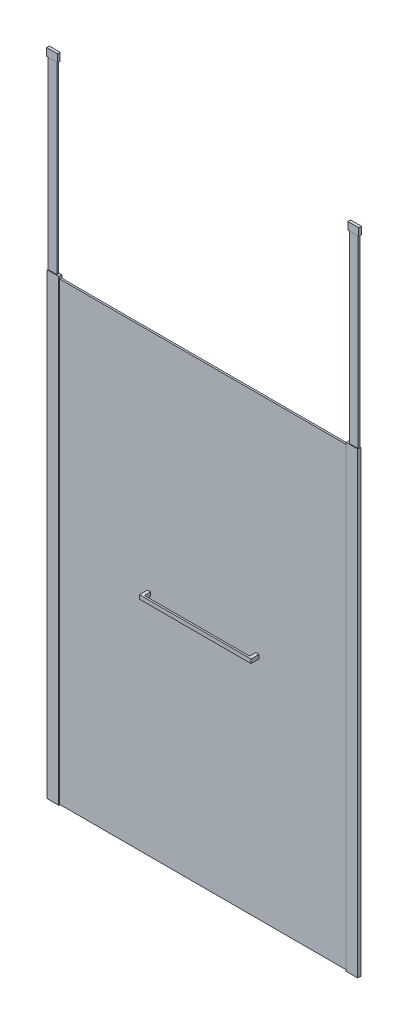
from build123d import *

# Parameters (mm, degrees)
DODANIE_WYCI_GNI_CIE1_START         = 3
DODANIE_WYCI_GNI_CIE1_DEPTH         = 2100
SZKIC2_W                            = 1347
SZKIC2_H                            = 8
DODANIE_WYCI_GNI_CIE2_DEPTH         = 2100
DODANIE_WYCI_GNI_CIE3_DEPTH         = 2108
SZKIC4_W                            = 53
SZKIC4_H                            = 14
DODANIE_WYCI_GNI_CIE4_DEPTH         = 11
SZKIC5_W                            = 53
SZKIC5_H                            = 14
DODANIE_WYCI_GNI_CIE5_DEPTH         = 3
SZKIC6_W                            = 8.1
SZKIC6_H                            = 7.8
DODANIE_WYCI_GNI_CIE6_DEPTH         = 15
SZKIC7_W                            = 53
SZKIC7_H                            = 14
DODANIE_WYCI_GNI_CIE7_DEPTH         = 3
SZKIC8_W                            = 53
SZKIC8_H                            = 14
DODANIE_WYCI_GNI_CIE8_DEPTH         = 3
SZKIC9_W                            = 40
SZKIC9_H                            = 8
DODANIE_WYCI_GNI_CIE9_DEPTH         = 883
DODANIE_WYCI_GNI_CIE9_2_DEPTH       = 883
DODANIE_WYCI_GNI_CIE10_START        = -32
SZKIC10_W                           = 50
SZKIC10_H                           = 12.5
DODANIE_WYCI_GNI_CIE10_DEPTH        = 35
DODANIE_WYCI_GNI_CIE11_DEPTH        = 36.5
DODANIE_WYCI_GNI_CIE11_DEPTH_BACK   = 18
SZKIC12_W                           = 15
SZKIC12_H                           = 18
DODANIE_WYCI_GNI_CIE11_2_DEPTH      = 36.5
DODANIE_WYCI_GNI_CIE11_2_DEPTH_BACK = 18
SZKIC13_W                           = 8
SZKIC13_H                           = 18
DODANIE_WYCI_GNI_CIE12_DEPTH        = 485


with BuildPart() as part:
    # Szkic1 → Dodanie-wyci_gni_cie1 (new body)
    with BuildSketch(Plane(origin=(0, 0, 0), x_dir=(1, 0, 0), z_dir=(0, 1, 0)).offset(DODANIE_WYCI_GNI_CIE1_START)):
        Polygon((0, 0), (0, 14), (53, 14), (53, 11), (42.9, 11), (42.9, 3), (53, 3), (53, 0), align=None)
    extrude(amount=DODANIE_WYCI_GNI_CIE1_DEPTH)

    # Szkic4 → Dodanie-wyci_gni_cie4 (add)
    with BuildSketch(Plane(origin=(0, 2103, 0), x_dir=(1, 0, 0), z_dir=(0, 1, 0))):
        with Locations((26.5, 7)):
            Rectangle(SZKIC4_W, SZKIC4_H)
    extrude(amount=DODANIE_WYCI_GNI_CIE4_DEPTH)

    # Szkic8 → Dodanie-wyci_gni_cie8 (add)
    with BuildSketch(Plane.XZ.offset(-3)):
        with Locations((26.5, -7)):
            Rectangle(SZKIC8_W, SZKIC8_H)
    extrude(amount=DODANIE_WYCI_GNI_CIE8_DEPTH)


with BuildPart() as body_2:
    # Szkic2 → Dodanie-wyci_gni_cie2 (new body)
    with BuildSketch(Plane.XZ.offset(-3)):
        with Locations((716.4, -7)):
            Rectangle(SZKIC2_W, SZKIC2_H)
    extrude(amount=-DODANIE_WYCI_GNI_CIE2_DEPTH)


with BuildPart() as body_3:
    # Szkic3 → Dodanie-wyci_gni_cie3 (new body)
    with BuildSketch(Plane.XZ.offset(-3)):
        Polygon((1379.8, -3), (1379.8, 0), (1432.8, 0), (1432.8, -14), (1379.8, -14), (1379.8, -11), (1389.9, -11), (1389.9, -3), align=None)
    extrude(amount=-DODANIE_WYCI_GNI_CIE3_DEPTH)

    # Szkic5 → Dodanie-wyci_gni_cie5 (add)
    with BuildSketch(Plane(origin=(0, 2111, 0), x_dir=(1, 0, 0), z_dir=(0, 1, 0))):
        with Locations((1406.3, 7)):
            Rectangle(SZKIC5_W, SZKIC5_H)
    extrude(amount=DODANIE_WYCI_GNI_CIE5_DEPTH)

    # Szkic6 → Dodanie-wyci_gni_cie6 (add)
    with BuildSketch(Plane.ZY.offset(-1379.8)):
        with Locations((-7, 2107.1)):
            Rectangle(SZKIC6_W, SZKIC6_H)
    extrude(amount=-DODANIE_WYCI_GNI_CIE6_DEPTH)

    # Szkic7 → Dodanie-wyci_gni_cie7 (add)
    with BuildSketch(Plane.XZ.offset(-3)):
        with Locations((1406.3, -7)):
            Rectangle(SZKIC7_W, SZKIC7_H)
    extrude(amount=DODANIE_WYCI_GNI_CIE7_DEPTH)


with BuildPart() as body_4:
    # Szkic9 → Dodanie-wyci_gni_cie9 (new body)
    with BuildSketch(Plane(origin=(0, 2114, 2099.6), x_dir=(-1, 0, 0), z_dir=(0, -1, 0))):
        with Locations((-1411.3, 2106.6)):
            Rectangle(SZKIC9_W, SZKIC9_H)
    extrude(amount=-DODANIE_WYCI_GNI_CIE9_DEPTH)

    # Szkic10 → Dodanie-wyci_gni_cie10 (add)
    with BuildSketch(Plane(origin=(0, 2997, 0), x_dir=(-1, 0, 0), z_dir=(0, 1, 0)).offset(DODANIE_WYCI_GNI_CIE10_START)):
        with Locations((-1411.3, -7)):
            Rectangle(SZKIC10_W, SZKIC10_H)
        with Locations((-21.5, -7)):
            Rectangle(SZKIC10_W, SZKIC10_H)
    extrude(amount=DODANIE_WYCI_GNI_CIE10_DEPTH)


with BuildPart() as body_5:
    # Szkic9 → Dodanie-wyci_gni_cie9 2 (new body)
    with BuildSketch(Plane(origin=(0, 2114, 2099.6), x_dir=(-1, 0, 0), z_dir=(0, -1, 0))):
        with Locations((-21.5, 2106.6)):
            Rectangle(SZKIC9_W, SZKIC9_H)
    extrude(amount=-DODANIE_WYCI_GNI_CIE9_2_DEPTH)


with BuildPart() as dodanie_wyci_gni_cie10_piece_1:
    # of the separate pieces the step leaves, piece 1, a body of its own (dodanie_wyci_gni_cie10_pieces)
    add(body_4.part.solids().sort_by_distance((1431.3, 2114, -11))[0])


with BuildPart() as dodanie_wyci_gni_cie10_piece_2:
    # of the separate pieces the step leaves, piece 2, a body of its own (dodanie_wyci_gni_cie10_pieces)
    add(body_4.part.solids().sort_by_distance((-3.5, 2965, -13.25))[0])


with BuildPart() as body_7:
    # Szkic12 → Dodanie-wyci_gni_cie11 (new, two sides: drawn at the far end of the back side and taken through both)
    with BuildSketch(Plane.XY.offset(-3).offset(-DODANIE_WYCI_GNI_CIE11_DEPTH_BACK)):
        with Locations((466.4, 1053)):
            Rectangle(SZKIC12_W, SZKIC12_H)
    extrude(amount=DODANIE_WYCI_GNI_CIE11_DEPTH + DODANIE_WYCI_GNI_CIE11_DEPTH_BACK)



with BuildPart() as body_8:
    # Szkic12 → Dodanie-wyci_gni_cie11 2 (new, two sides: drawn at the far end of the back side and taken through both)
    with BuildSketch(Plane.XY.offset(-3).offset(-DODANIE_WYCI_GNI_CIE11_2_DEPTH_BACK)):
        with Locations((966.4, 1053)):
            Rectangle(SZKIC12_W, SZKIC12_H)
    extrude(amount=DODANIE_WYCI_GNI_CIE11_2_DEPTH + DODANIE_WYCI_GNI_CIE11_2_DEPTH_BACK)


with BuildPart() as body_7_1:
    add(body_7.part)

    add(body_8.part)  # Dodanie-wyci_gni_cie12 merges body 8
    # Szkic13 → Dodanie-wyci_gni_cie12 (add)
    with BuildSketch(Plane(origin=(473.9, 0, 0), x_dir=(0, 0, -1), z_dir=(1, 0, 0))):
        with Locations((-29.5, 1053)):
            Rectangle(SZKIC13_W, SZKIC13_H)
    extrude(amount=DODANIE_WYCI_GNI_CIE12_DEPTH)


solid = Compound([part.part, body_2.part, body_3.part, body_5.part, dodanie_wyci_gni_cie10_piece_1.part, dodanie_wyci_gni_cie10_piece_2.part, body_7_1.part])
